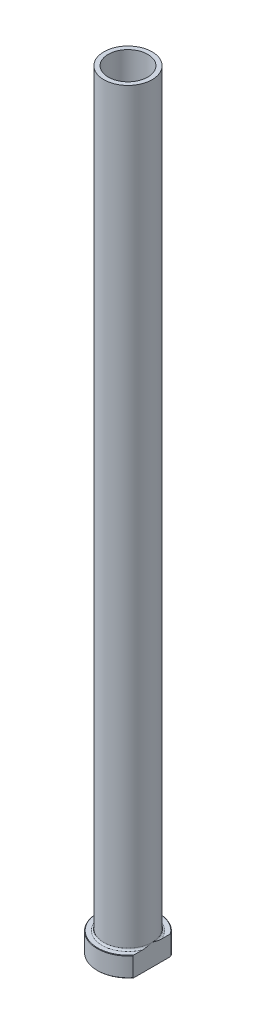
ISO-10303-21;
HEADER;
FILE_DESCRIPTION(('STEP AP214'),'2;1');
FILE_NAME('part.step','',(''),(''),'','','');
FILE_SCHEMA(('AUTOMOTIVE_DESIGN { 1 0 10303 214 1 1 1 1 }'));
ENDSEC;
DATA;
#1=APPLICATION_CONTEXT('core data for automotive mechanical design processes');
#2=APPLICATION_PROTOCOL_DEFINITION('international standard','automotive_design',2000,#1);
#3=PRODUCT_CONTEXT('',#1,'mechanical');
#4=PRODUCT('Part','Part','',(#3));
#5=PRODUCT_RELATED_PRODUCT_CATEGORY('part','',(#4));
#6=PRODUCT_DEFINITION_FORMATION('','',#4);
#7=PRODUCT_DEFINITION_CONTEXT('part definition',#1,'design');
#8=PRODUCT_DEFINITION('design','',#6,#7);
#9=PRODUCT_DEFINITION_SHAPE('','',#8);
#10=(LENGTH_UNIT() NAMED_UNIT(*) SI_UNIT(.MILLI.,.METRE.));
#11=(NAMED_UNIT(*) PLANE_ANGLE_UNIT() SI_UNIT($,.RADIAN.));
#12=(NAMED_UNIT(*) SI_UNIT($,.STERADIAN.) SOLID_ANGLE_UNIT());
#13=UNCERTAINTY_MEASURE_WITH_UNIT(LENGTH_MEASURE(1.E-05),#10,'distance_accuracy_value','');
#14=(GEOMETRIC_REPRESENTATION_CONTEXT(3) GLOBAL_UNCERTAINTY_ASSIGNED_CONTEXT((#13)) GLOBAL_UNIT_ASSIGNED_CONTEXT((#10,
#11,#12)) REPRESENTATION_CONTEXT('',''));
#15=CARTESIAN_POINT('',(0.,0.,0.));
#16=DIRECTION('',(0.,0.,1.));
#17=DIRECTION('',(1.,0.,0.));
#18=AXIS2_PLACEMENT_3D('',#15,#16,#17);
#19=CARTESIAN_POINT('',(0.,92.1876809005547,0.));
#20=DIRECTION('',(0.,1.,0.));
#21=DIRECTION('',(0.,0.,1.));
#22=AXIS2_PLACEMENT_3D('',#19,#20,#21);
#23=CYLINDRICAL_SURFACE('',#22,9.00000000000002);
#24=CARTESIAN_POINT('',(0.,350.,0.));
#25=DIRECTION('',(0.,1.,0.));
#26=DIRECTION('',(0.,0.,1.));
#27=AXIS2_PLACEMENT_3D('',#24,#25,#26);
#28=CIRCLE('',#27,9.00000000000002);
#29=CARTESIAN_POINT('',(0.,350.,9.00000000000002));
#30=VERTEX_POINT('',#29);
#31=EDGE_CURVE('E167',#30,#30,#28,.T.);
#32=ORIENTED_EDGE('',*,*,#31,.T.);
#33=EDGE_LOOP('',(#32));
#34=FACE_BOUND('',#33,.T.);
#35=CARTESIAN_POINT('',(0.,295.,0.));
#36=DIRECTION('',(0.,1.,0.));
#37=DIRECTION('',(0.,0.,1.));
#38=AXIS2_PLACEMENT_3D('',#35,#36,#37);
#39=CIRCLE('',#38,9.00000000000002);
#40=CARTESIAN_POINT('',(0.,295.,9.00000000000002));
#41=VERTEX_POINT('',#40);
#42=EDGE_CURVE('E170',#41,#41,#39,.T.);
#43=ORIENTED_EDGE('',*,*,#42,.F.);
#44=EDGE_LOOP('',(#43));
#45=FACE_BOUND('',#44,.T.);
#46=ADVANCED_FACE('F32',(#34,#45),#23,.F.);
#47=CARTESIAN_POINT('',(-9.00000000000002,350.,0.));
#48=DIRECTION('',(0.,1.,0.));
#49=DIRECTION('',(0.,0.,1.));
#50=AXIS2_PLACEMENT_3D('',#47,#48,#49);
#51=PLANE('',#50);
#52=CARTESIAN_POINT('',(0.,350.,0.));
#53=DIRECTION('',(0.,1.,0.));
#54=DIRECTION('',(0.,0.,1.));
#55=AXIS2_PLACEMENT_3D('',#52,#53,#54);
#56=CIRCLE('',#55,11.);
#57=CARTESIAN_POINT('',(0.,350.,11.));
#58=VERTEX_POINT('',#57);
#59=EDGE_CURVE('E174',#58,#58,#56,.T.);
#60=ORIENTED_EDGE('',*,*,#59,.T.);
#61=EDGE_LOOP('',(#60));
#62=FACE_BOUND('',#61,.T.);
#63=ORIENTED_EDGE('',*,*,#31,.F.);
#64=EDGE_LOOP('',(#63));
#65=FACE_BOUND('',#64,.T.);
#66=ADVANCED_FACE('F157',(#62,#65),#51,.T.);
#67=CARTESIAN_POINT('',(0.,92.1876809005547,0.));
#68=DIRECTION('',(0.,1.,0.));
#69=DIRECTION('',(0.,0.,1.));
#70=AXIS2_PLACEMENT_3D('',#67,#68,#69);
#71=CYLINDRICAL_SURFACE('',#70,11.);
#72=CARTESIAN_POINT('',(0.,9.8,0.));
#73=DIRECTION('',(0.,1.,0.));
#74=DIRECTION('',(0.,0.,1.));
#75=AXIS2_PLACEMENT_3D('',#72,#73,#74);
#76=CIRCLE('',#75,11.);
#77=CARTESIAN_POINT('',(11.,9.8,0.));
#78=VERTEX_POINT('',#77);
#79=EDGE_CURVE('E180',#78,#78,#76,.T.);
#80=ORIENTED_EDGE('',*,*,#79,.T.);
#81=EDGE_LOOP('',(#80));
#82=FACE_BOUND('',#81,.T.);
#83=ORIENTED_EDGE('',*,*,#59,.F.);
#84=EDGE_LOOP('',(#83));
#85=FACE_BOUND('',#84,.T.);
#86=ADVANCED_FACE('F162',(#82,#85),#71,.T.);
#87=CARTESIAN_POINT('',(-11.,9.,0.));
#88=DIRECTION('',(0.,1.,0.));
#89=DIRECTION('',(0.,0.,1.));
#90=AXIS2_PLACEMENT_3D('',#87,#88,#89);
#91=PLANE('',#90);
#92=DIRECTION('',(0.,0.,1.));
#93=VECTOR('',#92,1.);
#94=CARTESIAN_POINT('',(11.,9.,0.));
#95=LINE('',#94,#93);
#96=CARTESIAN_POINT('',(11.,9.,-8.33306666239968));
#97=VERTEX_POINT('',#96);
#98=CARTESIAN_POINT('',(11.,9.,-4.27083130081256));
#99=VERTEX_POINT('',#98);
#100=EDGE_CURVE('E54',#97,#99,#95,.T.);
#101=ORIENTED_EDGE('',*,*,#100,.F.);
#102=CARTESIAN_POINT('',(0.,9.,0.));
#103=DIRECTION('',(0.,1.,0.));
#104=DIRECTION('',(0.,0.,1.));
#105=AXIS2_PLACEMENT_3D('',#102,#103,#104);
#106=CIRCLE('',#105,13.7999999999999);
#107=CARTESIAN_POINT('',(11.,9.,8.33306666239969));
#108=VERTEX_POINT('',#107);
#109=EDGE_CURVE('E186',#97,#108,#106,.T.);
#110=ORIENTED_EDGE('',*,*,#109,.T.);
#111=CARTESIAN_POINT('',(11.,9.,4.27083130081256));
#112=VERTEX_POINT('',#111);
#113=EDGE_CURVE('E134',#112,#108,#95,.T.);
#114=ORIENTED_EDGE('',*,*,#113,.F.);
#115=CARTESIAN_POINT('',(0.,9.,0.));
#116=DIRECTION('',(0.,1.,0.));
#117=DIRECTION('',(0.,0.,1.));
#118=AXIS2_PLACEMENT_3D('',#115,#116,#117);
#119=CIRCLE('',#118,11.8);
#120=EDGE_CURVE('E183',#112,#99,#119,.F.);
#121=ORIENTED_EDGE('',*,*,#120,.T.);
#122=EDGE_LOOP('',(#101,#110,#114,#121));
#123=FACE_BOUND('',#122,.T.);
#124=ADVANCED_FACE('F197',(#123),#91,.T.);
#125=CARTESIAN_POINT('',(0.,92.1876809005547,0.));
#126=DIRECTION('',(0.,1.,0.));
#127=DIRECTION('',(0.,0.,1.));
#128=AXIS2_PLACEMENT_3D('',#125,#126,#127);
#129=CYLINDRICAL_SURFACE('',#128,14.);
#130=DIRECTION('',(0.,-1.,0.));
#131=VECTOR('',#130,1.);
#132=CARTESIAN_POINT('',(11.,350.,8.66025403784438));
#133=LINE('',#132,#131);
#134=CARTESIAN_POINT('',(11.,8.79999999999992,8.66025403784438));
#135=VERTEX_POINT('',#134);
#136=CARTESIAN_POINT('',(11.,0.200000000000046,8.66025403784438));
#137=VERTEX_POINT('',#136);
#138=EDGE_CURVE('E82',#135,#137,#133,.T.);
#139=ORIENTED_EDGE('',*,*,#138,.F.);
#140=CARTESIAN_POINT('',(0.,8.79999999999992,0.));
#141=DIRECTION('',(0.,1.,0.));
#142=DIRECTION('',(0.,0.,1.));
#143=AXIS2_PLACEMENT_3D('',#140,#141,#142);
#144=CIRCLE('',#143,14.);
#145=CARTESIAN_POINT('',(11.,8.79999999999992,-8.66025403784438));
#146=VERTEX_POINT('',#145);
#147=EDGE_CURVE('E95',#135,#146,#144,.F.);
#148=ORIENTED_EDGE('',*,*,#147,.T.);
#149=DIRECTION('',(0.,-1.,0.));
#150=VECTOR('',#149,1.);
#151=CARTESIAN_POINT('',(11.,350.,-8.66025403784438));
#152=LINE('',#151,#150);
#153=CARTESIAN_POINT('',(11.,0.200000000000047,-8.66025403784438));
#154=VERTEX_POINT('',#153);
#155=EDGE_CURVE('E192',#146,#154,#152,.T.);
#156=ORIENTED_EDGE('',*,*,#155,.T.);
#157=CARTESIAN_POINT('',(0.,0.200000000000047,0.));
#158=DIRECTION('',(0.,-1.,0.));
#159=DIRECTION('',(0.,0.,-1.));
#160=AXIS2_PLACEMENT_3D('',#157,#158,#159);
#161=CIRCLE('',#160,14.);
#162=EDGE_CURVE('E98',#154,#137,#161,.F.);
#163=ORIENTED_EDGE('',*,*,#162,.T.);
#164=EDGE_LOOP('',(#139,#148,#156,#163));
#165=FACE_BOUND('',#164,.T.);
#166=ADVANCED_FACE('F190',(#165),#129,.T.);
#167=CARTESIAN_POINT('',(-14.,0.,0.));
#168=DIRECTION('',(0.,-1.,0.));
#169=DIRECTION('',(0.,0.,-1.));
#170=AXIS2_PLACEMENT_3D('',#167,#168,#169);
#171=PLANE('',#170);
#172=CARTESIAN_POINT('',(0.,0.,0.));
#173=DIRECTION('',(0.,-1.,0.));
#174=DIRECTION('',(0.,0.,-1.));
#175=AXIS2_PLACEMENT_3D('',#172,#173,#174);
#176=CIRCLE('',#175,9.75000000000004);
#177=CARTESIAN_POINT('',(0.,0.,-9.75000000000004));
#178=VERTEX_POINT('',#177);
#179=EDGE_CURVE('E40',#178,#178,#176,.F.);
#180=ORIENTED_EDGE('',*,*,#179,.T.);
#181=EDGE_LOOP('',(#180));
#182=FACE_BOUND('',#181,.T.);
#183=DIRECTION('',(0.,0.,-1.));
#184=VECTOR('',#183,1.);
#185=CARTESIAN_POINT('',(11.,0.,8.66025403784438));
#186=LINE('',#185,#184);
#187=CARTESIAN_POINT('',(11.,0.,8.33306666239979));
#188=VERTEX_POINT('',#187);
#189=CARTESIAN_POINT('',(11.,0.,-8.33306666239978));
#190=VERTEX_POINT('',#189);
#191=EDGE_CURVE('E47',#188,#190,#186,.T.);
#192=ORIENTED_EDGE('',*,*,#191,.F.);
#193=CARTESIAN_POINT('',(0.,0.,0.));
#194=DIRECTION('',(0.,-1.,0.));
#195=DIRECTION('',(0.,0.,-1.));
#196=AXIS2_PLACEMENT_3D('',#193,#194,#195);
#197=CIRCLE('',#196,13.7999999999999);
#198=EDGE_CURVE('E92',#188,#190,#197,.T.);
#199=ORIENTED_EDGE('',*,*,#198,.T.);
#200=EDGE_LOOP('',(#192,#199));
#201=FACE_BOUND('',#200,.T.);
#202=ADVANCED_FACE('F91',(#182,#201),#171,.T.);
#203=CARTESIAN_POINT('',(0.,92.1876809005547,0.));
#204=DIRECTION('',(0.,1.,0.));
#205=DIRECTION('',(0.,0.,1.));
#206=AXIS2_PLACEMENT_3D('',#203,#204,#205);
#207=CYLINDRICAL_SURFACE('',#206,9.25000000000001);
#208=CARTESIAN_POINT('',(0.,0.500000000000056,0.));
#209=DIRECTION('',(0.,-1.,0.));
#210=DIRECTION('',(0.,0.,-1.));
#211=AXIS2_PLACEMENT_3D('',#208,#209,#210);
#212=CIRCLE('',#211,9.25000000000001);
#213=CARTESIAN_POINT('',(0.,0.500000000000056,-9.25000000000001));
#214=VERTEX_POINT('',#213);
#215=EDGE_CURVE('E11',#214,#214,#212,.T.);
#216=ORIENTED_EDGE('',*,*,#215,.T.);
#217=EDGE_LOOP('',(#216));
#218=FACE_BOUND('',#217,.T.);
#219=CARTESIAN_POINT('',(0.,283.,0.));
#220=DIRECTION('',(0.,1.,0.));
#221=DIRECTION('',(0.,0.,1.));
#222=AXIS2_PLACEMENT_3D('',#219,#220,#221);
#223=CIRCLE('',#222,9.25000000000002);
#224=CARTESIAN_POINT('',(0.,283.,9.25000000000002));
#225=VERTEX_POINT('',#224);
#226=EDGE_CURVE('E172',#225,#225,#223,.T.);
#227=ORIENTED_EDGE('',*,*,#226,.T.);
#228=EDGE_LOOP('',(#227));
#229=FACE_BOUND('',#228,.T.);
#230=ADVANCED_FACE('F215',(#218,#229),#207,.F.);
#231=CARTESIAN_POINT('',(0.,283.,0.));
#232=DIRECTION('',(0.,-1.,0.));
#233=DIRECTION('',(0.,0.,-1.));
#234=AXIS2_PLACEMENT_3D('',#231,#232,#233);
#235=CONICAL_SURFACE('',#234,9.25000000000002,0.0208303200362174);
#236=ORIENTED_EDGE('',*,*,#42,.T.);
#237=EDGE_LOOP('',(#236));
#238=FACE_BOUND('',#237,.T.);
#239=ORIENTED_EDGE('',*,*,#226,.F.);
#240=EDGE_LOOP('',(#239));
#241=FACE_BOUND('',#240,.T.);
#242=ADVANCED_FACE('F111',(#238,#241),#235,.F.);
#243=CARTESIAN_POINT('',(0.,9.8,0.));
#244=DIRECTION('',(0.,1.,0.));
#245=DIRECTION('',(0.,0.,1.));
#246=AXIS2_PLACEMENT_3D('',#243,#244,#245);
#247=TOROIDAL_SURFACE('',#246,11.8,0.8);
#248=ORIENTED_EDGE('',*,*,#120,.F.);
#249=CARTESIAN_POINT('',(11.,9.8,0.));
#250=CARTESIAN_POINT('',(11.,9.8000010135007,-1.1690142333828E-10));
#251=CARTESIAN_POINT('',(11.,9.80000202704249,3.62636844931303E-07));
#252=CARTESIAN_POINT('',(11.,9.80000392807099,1.38767088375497E-06));
#253=CARTESIAN_POINT('',(11.,9.80000479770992,2.07263830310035E-06));
#254=CARTESIAN_POINT('',(11.,9.80000659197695,3.71036756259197E-06));
#255=CARTESIAN_POINT('',(11.,9.80000749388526,4.6893031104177E-06));
#256=CARTESIAN_POINT('',(11.,9.8000091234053,6.73011686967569E-06));
#257=CARTESIAN_POINT('',(11.,9.80000985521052,7.78888257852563E-06));
#258=CARTESIAN_POINT('',(11.,9.8000125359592,1.18457672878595E-05));
#259=CARTESIAN_POINT('',(11.,9.80001433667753,1.49465092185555E-05));
#260=CARTESIAN_POINT('',(11.,9.8000173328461,2.112267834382E-05));
#261=CARTESIAN_POINT('',(11.,9.80001856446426,2.41813383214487E-05));
#262=CARTESIAN_POINT('',(11.,9.80002366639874,3.70013792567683E-05));
#263=CARTESIAN_POINT('',(11.,9.80002742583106,4.68141765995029E-05));
#264=CARTESIAN_POINT('',(11.,9.80003302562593,6.54425732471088E-05));
#265=CARTESIAN_POINT('',(11.,9.80003506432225,7.4198414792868E-05));
#266=CARTESIAN_POINT('',(11.,9.80004981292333,0.000138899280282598));
#267=CARTESIAN_POINT('',(11.,9.80006088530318,0.000195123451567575));
#268=CARTESIAN_POINT('',(11.,9.80010935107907,0.000417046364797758));
#269=CARTESIAN_POINT('',(11.,9.80015570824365,0.00058074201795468));
#270=CARTESIAN_POINT('',(11.,9.80033600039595,0.001228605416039));
#271=CARTESIAN_POINT('',(11.,9.80046404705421,0.00171390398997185));
#272=CARTESIAN_POINT('',(11.,9.8009765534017,0.00364143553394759));
#273=CARTESIAN_POINT('',(11.,9.80136837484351,0.0050822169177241));
#274=CARTESIAN_POINT('',(11.,9.80300002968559,0.0110983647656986));
#275=CARTESIAN_POINT('',(11.,9.80423069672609,0.0156755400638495));
#276=CARTESIAN_POINT('',(10.9999999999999,9.82474721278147,0.0919599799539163));
#277=CARTESIAN_POINT('',(11.,9.84411511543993,0.163651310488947));
#278=CARTESIAN_POINT('',(11.,9.88193435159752,0.304144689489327));
#279=CARTESIAN_POINT('',(11.,9.9003908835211,0.372945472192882));
#280=CARTESIAN_POINT('',(11.,9.93953155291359,0.519420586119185));
#281=CARTESIAN_POINT('',(11.,9.96019740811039,0.597099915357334));
#282=CARTESIAN_POINT('',(11.,10.001471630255,0.753402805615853));
#283=CARTESIAN_POINT('',(11.,10.0220767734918,0.832027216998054));
#284=CARTESIAN_POINT('',(11.,10.0569012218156,0.966276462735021));
#285=CARTESIAN_POINT('',(11.,10.0712190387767,1.02187571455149));
#286=CARTESIAN_POINT('',(11.,10.0995828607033,1.13298938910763));
#287=CARTESIAN_POINT('',(11.,10.1136294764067,1.18850365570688));
#288=CARTESIAN_POINT('',(11.,10.1546367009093,1.35225812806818));
#289=CARTESIAN_POINT('',(11.,10.1812165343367,1.46059357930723));
#290=CARTESIAN_POINT('',(11.,10.2669117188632,1.81933910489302));
#291=CARTESIAN_POINT('',(11.,10.3231642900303,2.07044657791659));
#292=CARTESIAN_POINT('',(11.,10.4250125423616,2.57779828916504));
#293=CARTESIAN_POINT('',(11.,10.4704839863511,2.8340686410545));
#294=CARTESIAN_POINT('',(11.,10.5272211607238,3.23096220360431));
#295=CARTESIAN_POINT('',(11.,10.5446090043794,3.37070252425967));
#296=CARTESIAN_POINT('',(11.,10.5730475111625,3.6508143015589));
#297=CARTESIAN_POINT('',(11.,10.5840998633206,3.79118557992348));
#298=CARTESIAN_POINT('',(11.,10.5982304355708,4.07161741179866));
#299=CARTESIAN_POINT('',(11.,10.6013499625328,4.21167576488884));
#300=CARTESIAN_POINT('',(11.,10.5975625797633,4.49161919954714));
#301=CARTESIAN_POINT('',(11.,10.5906655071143,4.63150431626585));
#302=CARTESIAN_POINT('',(11.,10.5704363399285,4.8393109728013));
#303=CARTESIAN_POINT('',(11.,10.5621463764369,4.90772588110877));
#304=CARTESIAN_POINT('',(11.,10.5417448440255,5.04405523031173));
#305=CARTESIAN_POINT('',(11.,10.5296301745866,5.11196921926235));
#306=CARTESIAN_POINT('',(11.,10.5009997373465,5.2461029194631));
#307=CARTESIAN_POINT('',(11.,10.4845340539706,5.31233305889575));
#308=CARTESIAN_POINT('',(11.,10.4461783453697,5.44314716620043));
#309=CARTESIAN_POINT('',(11.,10.424294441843,5.50773290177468));
#310=CARTESIAN_POINT('',(11.,10.3734211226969,5.63494480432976));
#311=CARTESIAN_POINT('',(11.,10.344361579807,5.69754429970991));
#312=CARTESIAN_POINT('',(11.,10.2940125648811,5.7875857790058));
#313=CARTESIAN_POINT('',(11.,10.2761248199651,5.81692841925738));
#314=CARTESIAN_POINT('',(11.,10.2377448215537,5.87384301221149));
#315=CARTESIAN_POINT('',(11.,10.2172553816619,5.90141683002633));
#316=CARTESIAN_POINT('',(11.,10.1754926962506,5.95144540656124));
#317=CARTESIAN_POINT('',(11.,10.1545053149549,5.97413611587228));
#318=CARTESIAN_POINT('',(11.,10.109817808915,6.01675330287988));
#319=CARTESIAN_POINT('',(11.,10.0861159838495,6.03667803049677));
#320=CARTESIAN_POINT('',(11.,10.0355211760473,6.07288913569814));
#321=CARTESIAN_POINT('',(11.,10.008588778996,6.08912169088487));
#322=CARTESIAN_POINT('',(11.,9.95208821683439,6.11604527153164));
#323=CARTESIAN_POINT('',(11.,9.92252876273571,6.12675386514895));
#324=CARTESIAN_POINT('',(11.,9.87044933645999,6.13915978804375));
#325=CARTESIAN_POINT('',(11.,9.84833164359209,6.14255775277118));
#326=CARTESIAN_POINT('',(11.,9.80383923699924,6.14553082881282));
#327=CARTESIAN_POINT('',(11.,9.78146463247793,6.14510750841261));
#328=CARTESIAN_POINT('',(11.,9.73715415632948,6.14047859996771));
#329=CARTESIAN_POINT('',(11.,9.71521765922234,6.13627886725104));
#330=CARTESIAN_POINT('',(11.,9.67228934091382,6.12446633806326));
#331=CARTESIAN_POINT('',(11.,9.6512982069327,6.11685110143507));
#332=CARTESIAN_POINT('',(11.,9.60293880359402,6.09531376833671));
#333=CARTESIAN_POINT('',(11.,9.57614979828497,6.08009633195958));
#334=CARTESIAN_POINT('',(11.,9.52533680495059,6.04559207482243));
#335=CARTESIAN_POINT('',(11.,9.50131971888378,6.02629542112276));
#336=CARTESIAN_POINT('',(11.,9.44252607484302,5.97248581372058));
#337=CARTESIAN_POINT('',(11.,9.40981527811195,5.93573547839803));
#338=CARTESIAN_POINT('',(11.,9.35019076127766,5.85789950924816));
#339=CARTESIAN_POINT('',(11.,9.32328591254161,5.81680738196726));
#340=CARTESIAN_POINT('',(11.,9.27531247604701,5.73382009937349));
#341=CARTESIAN_POINT('',(11.,9.25403723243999,5.69204233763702));
#342=CARTESIAN_POINT('',(11.,9.2150716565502,5.60682590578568));
#343=CARTESIAN_POINT('',(11.,9.19738479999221,5.56338567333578));
#344=CARTESIAN_POINT('',(11.,9.16492416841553,5.47505507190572));
#345=CARTESIAN_POINT('',(11.,9.15017444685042,5.43015597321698));
#346=CARTESIAN_POINT('',(11.,9.12332484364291,5.33960740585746));
#347=CARTESIAN_POINT('',(11.,9.11122363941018,5.29395832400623));
#348=CARTESIAN_POINT('',(11.,9.08512909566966,5.18461425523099));
#349=CARTESIAN_POINT('',(11.,9.07217244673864,5.12067246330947));
#350=CARTESIAN_POINT('',(11.,9.04991113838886,4.99214785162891));
#351=CARTESIAN_POINT('',(11.,9.04060805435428,4.92756476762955));
#352=CARTESIAN_POINT('',(11.,9.01731839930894,4.73294213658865));
#353=CARTESIAN_POINT('',(11.,9.00801869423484,4.60233754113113));
#354=CARTESIAN_POINT('',(11.,8.99902947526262,4.34550193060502));
#355=CARTESIAN_POINT('',(11.,8.99901276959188,4.21927902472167));
#356=CARTESIAN_POINT('',(11.,9.00595929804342,3.96771196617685));
#357=CARTESIAN_POINT('',(11.,9.01288556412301,3.84236670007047));
#358=CARTESIAN_POINT('',(11.,9.03307410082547,3.58284783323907));
#359=CARTESIAN_POINT('',(11.,9.04676832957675,3.44870920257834));
#360=CARTESIAN_POINT('',(11.,9.07939011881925,3.18114709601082));
#361=CARTESIAN_POINT('',(11.,9.09831526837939,3.04772331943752));
#362=CARTESIAN_POINT('',(11.,9.14092023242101,2.77842123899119));
#363=CARTESIAN_POINT('',(11.,9.16470161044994,2.64255921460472));
#364=CARTESIAN_POINT('',(11.,9.21593088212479,2.37116504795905));
#365=CARTESIAN_POINT('',(11.,9.24338827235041,2.23563471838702));
#366=CARTESIAN_POINT('',(11.,9.31183649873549,1.91532204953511));
#367=CARTESIAN_POINT('',(11.,9.35408384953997,1.73080986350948));
#368=CARTESIAN_POINT('',(11.,9.44184141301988,1.36477440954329));
#369=CARTESIAN_POINT('',(11.,9.48730948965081,1.18324089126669));
#370=CARTESIAN_POINT('',(11.,9.55452451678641,0.921934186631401));
#371=CARTESIAN_POINT('',(11.,9.57534575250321,0.841920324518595));
#372=CARTESIAN_POINT('',(11.,9.61742284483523,0.681633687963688));
#373=CARTESIAN_POINT('',(11.,9.63868020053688,0.601361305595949));
#374=CARTESIAN_POINT('',(11.,9.68246779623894,0.436916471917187));
#375=CARTESIAN_POINT('',(11.,9.70500908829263,0.35274702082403));
#376=CARTESIAN_POINT('',(11.,9.74991333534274,0.185809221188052));
#377=CARTESIAN_POINT('',(11.0000000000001,9.77227331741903,0.103040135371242));
#378=CARTESIAN_POINT('',(11.,9.79577053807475,0.0156708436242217));
#379=CARTESIAN_POINT('',(11.,9.79700248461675,0.0110889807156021));
#380=CARTESIAN_POINT('',(11.,9.79863444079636,0.00507176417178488));
#381=CARTESIAN_POINT('',(11.,9.79902527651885,0.00363459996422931));
#382=CARTESIAN_POINT('',(11.,9.79953658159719,0.00171158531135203));
#383=CARTESIAN_POINT('',(11.,9.7996643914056,0.00122718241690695));
#384=CARTESIAN_POINT('',(11.,9.79984439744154,0.000580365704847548));
#385=CARTESIAN_POINT('',(11.,9.79989071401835,0.000416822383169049));
#386=CARTESIAN_POINT('',(11.,9.79993914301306,0.000195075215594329));
#387=CARTESIAN_POINT('',(11.,9.79995021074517,0.000138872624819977));
#388=CARTESIAN_POINT('',(11.,9.79996494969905,7.41937272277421E-05));
#389=CARTESIAN_POINT('',(11.,9.79996698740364,6.54391041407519E-05));
#390=CARTESIAN_POINT('',(11.,9.79997258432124,4.68131883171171E-05));
#391=CARTESIAN_POINT('',(11.,9.79997634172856,3.7001588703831E-05));
#392=CARTESIAN_POINT('',(11.,9.7999814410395,2.41827838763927E-05));
#393=CARTESIAN_POINT('',(11.,9.79998267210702,2.11242150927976E-05));
#394=CARTESIAN_POINT('',(11.,9.79998566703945,1.4948136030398E-05));
#395=CARTESIAN_POINT('',(11.,9.79998746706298,1.18473819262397E-05));
#396=CARTESIAN_POINT('',(11.,9.79999014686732,7.79037294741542E-06));
#397=CARTESIAN_POINT('',(11.,9.79999087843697,6.73154510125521E-06));
#398=CARTESIAN_POINT('',(11.,9.79999250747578,4.69056454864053E-06));
#399=CARTESIAN_POINT('',(11.,9.79999340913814,3.7115229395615E-06));
#400=CARTESIAN_POINT('',(11.,9.79999520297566,2.0735436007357E-06));
#401=CARTESIAN_POINT('',(11.,9.79999607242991,1.38844123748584E-06));
#402=CARTESIAN_POINT('',(11.,9.79999797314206,3.63067802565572E-07));
#403=CARTESIAN_POINT('',(11.,9.79999898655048,1.16899927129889E-10));
#404=CARTESIAN_POINT('',(11.,9.8,0.));
#405=B_SPLINE_CURVE_WITH_KNOTS('',3,(#249,#250,#251,#252,#253,#254,#255,#256,#257,#258,#259,
#260,#261,#262,#263,#264,#265,#266,#267,#268,#269,#270,#271,#272,#273,#274,#275,#276,#277,#278,
#279,#280,#281,#282,#283,#284,#285,#286,#287,#288,#289,#290,#291,#292,#293,#294,#295,#296,#297,
#298,#299,#300,#301,#302,#303,#304,#305,#306,#307,#308,#309,#310,#311,#312,#313,#314,#315,#316,
#317,#318,#319,#320,#321,#322,#323,#324,#325,#326,#327,#328,#329,#330,#331,#332,#333,#334,#335,
#336,#337,#338,#339,#340,#341,#342,#343,#344,#345,#346,#347,#348,#349,#350,#351,#352,#353,#354,
#355,#356,#357,#358,#359,#360,#361,#362,#363,#364,#365,#366,#367,#368,#369,#370,#371,#372,#373,
#374,#375,#376,#377,#378,#379,#380,#381,#382,#383,#384,#385,#386,#387,#388,#389,#390,#391,#392,
#393,#394,#395,#396,#397,#398,#399,#400,#401,#402,#403,#404),.UNSPECIFIED.,.T.,.F.,(4,2,2,2,2,2,
2,2,2,2,2,2,2,2,2,2,2,2,2,2,2,2,2,2,2,2,2,2,2,2,2,2,2,2,2,2,2,2,2,2,2,2,2,2,2,2,2,2,2,2,2,2,2,2,
2,2,2,2,2,2,2,2,2,2,2,2,2,2,2,2,2,2,2,2,2,2,2,4),(0.,3.06075816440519E-06,6.37973016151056E-06,
1.03502600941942E-05,1.42089639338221E-05,2.49252461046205E-05,3.4808542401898E-05,
6.62739268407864E-05,9.32104281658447E-05,0.000265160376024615,0.000775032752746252,
0.00228129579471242,0.00675996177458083,0.0209798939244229,0.243756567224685,0.457458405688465,
0.698601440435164,0.94243948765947,1.11467870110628,1.28646938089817,1.62111125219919,
2.39296447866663,3.17332138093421,3.59566656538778,4.01789910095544,4.43792849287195,
4.85754566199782,5.06420795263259,5.27103820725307,5.47558418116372,5.67990009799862,
5.88629782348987,5.98928489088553,6.09216151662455,6.18469603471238,6.27728883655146,
6.37115541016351,6.46472158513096,6.53154940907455,6.59834980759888,6.66504681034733,
6.73179153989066,6.82369899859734,6.91583057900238,7.06259901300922,7.20959014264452,
7.35003074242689,7.49060673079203,7.63229046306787,7.77390328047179,7.96948934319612,
8.1651596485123,8.55744262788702,8.93589815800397,9.31234923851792,9.7167301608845,
10.1209250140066,10.5346477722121,10.9494607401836,11.5172595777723,12.0786596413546,
12.3266950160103,12.5758117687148,12.8372206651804,13.0944202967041,13.1086548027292,
13.1131222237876,13.1146257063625,13.1151351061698,13.1153069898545,13.1153339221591,
13.1153653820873,13.1153752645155,13.1153859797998,13.1153898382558,13.1153938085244,
13.1153971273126,13.1154001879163),.UNSPECIFIED.);
#406=EDGE_CURVE('E126',#112,#78,#405,.T.);
#407=ORIENTED_EDGE('',*,*,#406,.T.);
#408=ORIENTED_EDGE('',*,*,#79,.F.);
#409=CARTESIAN_POINT('',(11.,9.8,0.));
#410=CARTESIAN_POINT('',(11.,9.79999898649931,1.16906269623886E-10));
#411=CARTESIAN_POINT('',(11.,9.79999797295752,-3.62636839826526E-07));
#412=CARTESIAN_POINT('',(11.,9.79999607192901,-1.38767087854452E-06));
#413=CARTESIAN_POINT('',(11.,9.79999520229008,-2.07263829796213E-06));
#414=CARTESIAN_POINT('',(11.,9.79999340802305,-3.71036755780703E-06));
#415=CARTESIAN_POINT('',(11.,9.79999250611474,-4.68930310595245E-06));
#416=CARTESIAN_POINT('',(11.,9.79999087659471,-6.73011686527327E-06));
#417=CARTESIAN_POINT('',(11.,9.79999014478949,-7.78888257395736E-06));
#418=CARTESIAN_POINT('',(11.,9.7999874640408,-1.18457672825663E-05));
#419=CARTESIAN_POINT('',(11.,9.79998566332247,-1.49465092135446E-05));
#420=CARTESIAN_POINT('',(11.,9.7999826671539,-2.11226783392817E-05));
#421=CARTESIAN_POINT('',(11.,9.79998143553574,-2.41813383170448E-05));
#422=CARTESIAN_POINT('',(11.,9.79997633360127,-3.70013792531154E-05));
#423=CARTESIAN_POINT('',(11.,9.79997257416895,-4.6814176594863E-05));
#424=CARTESIAN_POINT('',(11.,9.79996697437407,-6.54425732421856E-05));
#425=CARTESIAN_POINT('',(11.,9.79996493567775,-7.41984147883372E-05));
#426=CARTESIAN_POINT('',(11.,9.79995018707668,-0.000138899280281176));
#427=CARTESIAN_POINT('',(11.,9.79993911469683,-0.000195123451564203));
#428=CARTESIAN_POINT('',(11.,9.79989064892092,-0.000417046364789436));
#429=CARTESIAN_POINT('',(11.,9.79984429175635,-0.000580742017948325));
#430=CARTESIAN_POINT('',(11.,9.79966399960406,-0.00122860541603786));
#431=CARTESIAN_POINT('',(11.,9.7995359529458,-0.00171390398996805));
#432=CARTESIAN_POINT('',(11.,9.79902344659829,-0.00364143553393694));
#433=CARTESIAN_POINT('',(11.,9.79863162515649,-0.00508221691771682));
#434=CARTESIAN_POINT('',(11.,9.79699997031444,-0.0110983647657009));
#435=CARTESIAN_POINT('',(11.,9.79576930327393,-0.0156755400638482));
#436=CARTESIAN_POINT('',(11.0000000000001,9.77525278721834,-0.0919599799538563));
#437=CARTESIAN_POINT('',(11.,9.75588488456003,-0.163651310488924));
#438=CARTESIAN_POINT('',(11.,9.71806564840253,-0.304144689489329));
#439=CARTESIAN_POINT('',(11.,9.69960911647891,-0.372945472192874));
#440=CARTESIAN_POINT('',(11.,9.6604684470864,-0.519420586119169));
#441=CARTESIAN_POINT('',(11.,9.63980259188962,-0.597099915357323));
#442=CARTESIAN_POINT('',(11.,9.59852836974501,-0.753402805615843));
#443=CARTESIAN_POINT('',(11.,9.5779232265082,-0.832027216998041));
#444=CARTESIAN_POINT('',(11.,9.54309877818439,-0.966276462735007));
#445=CARTESIAN_POINT('',(11.,9.52878096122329,-1.02187571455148));
#446=CARTESIAN_POINT('',(11.,9.50041713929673,-1.13298938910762));
#447=CARTESIAN_POINT('',(11.,9.48637052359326,-1.18850365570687));
#448=CARTESIAN_POINT('',(11.,9.44536329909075,-1.35225812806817));
#449=CARTESIAN_POINT('',(11.,9.41878346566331,-1.46059357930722));
#450=CARTESIAN_POINT('',(11.,9.33308828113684,-1.81933910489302));
#451=CARTESIAN_POINT('',(11.,9.27683570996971,-2.07044657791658));
#452=CARTESIAN_POINT('',(11.,9.17498745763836,-2.57779828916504));
#453=CARTESIAN_POINT('',(11.,9.12951601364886,-2.8340686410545));
#454=CARTESIAN_POINT('',(11.,9.0727788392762,-3.23096220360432));
#455=CARTESIAN_POINT('',(11.,9.05539099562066,-3.37070252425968));
#456=CARTESIAN_POINT('',(11.,9.02695248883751,-3.6508143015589));
#457=CARTESIAN_POINT('',(11.,9.01590013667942,-3.79118557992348));
#458=CARTESIAN_POINT('',(11.,9.00176956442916,-4.07161741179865));
#459=CARTESIAN_POINT('',(11.,8.99865003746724,-4.21167576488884));
#460=CARTESIAN_POINT('',(11.,9.00243742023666,-4.49161919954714));
#461=CARTESIAN_POINT('',(11.,9.00933449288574,-4.63150431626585));
#462=CARTESIAN_POINT('',(11.,9.02956366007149,-4.8393109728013));
#463=CARTESIAN_POINT('',(11.,9.03785362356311,-4.90772588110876));
#464=CARTESIAN_POINT('',(11.,9.05825515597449,-5.04405523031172));
#465=CARTESIAN_POINT('',(11.,9.07036982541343,-5.11196921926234));
#466=CARTESIAN_POINT('',(11.,9.0990002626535,-5.24610291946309));
#467=CARTESIAN_POINT('',(11.,9.11546594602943,-5.31233305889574));
#468=CARTESIAN_POINT('',(11.,9.1538216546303,-5.44314716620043));
#469=CARTESIAN_POINT('',(11.,9.17570555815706,-5.50773290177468));
#470=CARTESIAN_POINT('',(11.,9.22657887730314,-5.63494480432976));
#471=CARTESIAN_POINT('',(11.,9.25563842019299,-5.69754429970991));
#472=CARTESIAN_POINT('',(11.,9.30598743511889,-5.78758577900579));
#473=CARTESIAN_POINT('',(11.,9.32387518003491,-5.81692841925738));
#474=CARTESIAN_POINT('',(11.,9.36225517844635,-5.87384301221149));
#475=CARTESIAN_POINT('',(11.,9.38274461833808,-5.90141683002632));
#476=CARTESIAN_POINT('',(11.,9.42450730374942,-5.95144540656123));
#477=CARTESIAN_POINT('',(11.,9.44549468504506,-5.97413611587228));
#478=CARTESIAN_POINT('',(11.,9.490182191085,-6.01675330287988));
#479=CARTESIAN_POINT('',(11.,9.51388401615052,-6.03667803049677));
#480=CARTESIAN_POINT('',(11.,9.56447882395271,-6.07288913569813));
#481=CARTESIAN_POINT('',(11.,9.59141122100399,-6.08912169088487));
#482=CARTESIAN_POINT('',(11.,9.64791178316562,-6.11604527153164));
#483=CARTESIAN_POINT('',(11.,9.67747123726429,-6.12675386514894));
#484=CARTESIAN_POINT('',(11.,9.72955066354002,-6.13915978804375));
#485=CARTESIAN_POINT('',(11.,9.75166835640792,-6.14255775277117));
#486=CARTESIAN_POINT('',(11.,9.79616076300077,-6.14553082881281));
#487=CARTESIAN_POINT('',(11.,9.81853536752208,-6.14510750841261));
#488=CARTESIAN_POINT('',(11.,9.86284584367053,-6.14047859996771));
#489=CARTESIAN_POINT('',(11.,9.88478234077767,-6.13627886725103));
#490=CARTESIAN_POINT('',(11.,9.92771065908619,-6.12446633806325));
#491=CARTESIAN_POINT('',(11.,9.94870179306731,-6.11685110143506));
#492=CARTESIAN_POINT('',(11.,9.99706119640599,-6.0953137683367));
#493=CARTESIAN_POINT('',(11.,10.023850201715,-6.08009633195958));
#494=CARTESIAN_POINT('',(11.,10.0746631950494,-6.04559207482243));
#495=CARTESIAN_POINT('',(11.,10.0986802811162,-6.02629542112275));
#496=CARTESIAN_POINT('',(11.,10.157473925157,-5.97248581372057));
#497=CARTESIAN_POINT('',(11.,10.1901847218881,-5.93573547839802));
#498=CARTESIAN_POINT('',(11.,10.2498092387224,-5.85789950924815));
#499=CARTESIAN_POINT('',(11.,10.2767140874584,-5.81680738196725));
#500=CARTESIAN_POINT('',(11.,10.324687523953,-5.73382009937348));
#501=CARTESIAN_POINT('',(11.,10.34596276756,-5.692042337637));
#502=CARTESIAN_POINT('',(11.,10.3849283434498,-5.60682590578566));
#503=CARTESIAN_POINT('',(11.,10.4026152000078,-5.56338567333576));
#504=CARTESIAN_POINT('',(11.,10.4350758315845,-5.47505507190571));
#505=CARTESIAN_POINT('',(11.,10.4498255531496,-5.43015597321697));
#506=CARTESIAN_POINT('',(11.,10.4766751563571,-5.33960740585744));
#507=CARTESIAN_POINT('',(11.,10.4887763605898,-5.2939583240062));
#508=CARTESIAN_POINT('',(11.,10.5148709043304,-5.18461425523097));
#509=CARTESIAN_POINT('',(11.,10.5278275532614,-5.12067246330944));
#510=CARTESIAN_POINT('',(11.,10.5500888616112,-4.99214785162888));
#511=CARTESIAN_POINT('',(11.,10.5593919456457,-4.92756476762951));
#512=CARTESIAN_POINT('',(11.,10.5826816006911,-4.73294213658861));
#513=CARTESIAN_POINT('',(11.,10.5919813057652,-4.60233754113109));
#514=CARTESIAN_POINT('',(11.,10.6009705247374,-4.34550193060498));
#515=CARTESIAN_POINT('',(11.,10.6009872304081,-4.21927902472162));
#516=CARTESIAN_POINT('',(11.,10.5940407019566,-3.96771196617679));
#517=CARTESIAN_POINT('',(11.,10.587114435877,-3.84236670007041));
#518=CARTESIAN_POINT('',(11.,10.5669258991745,-3.58284783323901));
#519=CARTESIAN_POINT('',(11.,10.5532316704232,-3.44870920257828));
#520=CARTESIAN_POINT('',(11.,10.5206098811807,-3.18114709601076));
#521=CARTESIAN_POINT('',(11.,10.5016847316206,-3.04772331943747));
#522=CARTESIAN_POINT('',(11.,10.459079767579,-2.77842123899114));
#523=CARTESIAN_POINT('',(11.,10.4352983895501,-2.64255921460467));
#524=CARTESIAN_POINT('',(11.,10.3840691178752,-2.37116504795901));
#525=CARTESIAN_POINT('',(11.,10.3566117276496,-2.23563471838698));
#526=CARTESIAN_POINT('',(11.,10.2881635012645,-1.91532204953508));
#527=CARTESIAN_POINT('',(11.,10.24591615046,-1.73080986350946));
#528=CARTESIAN_POINT('',(11.,10.1581585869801,-1.36477440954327));
#529=CARTESIAN_POINT('',(11.,10.1126905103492,-1.18324089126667));
#530=CARTESIAN_POINT('',(11.,10.0454754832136,-0.921934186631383));
#531=CARTESIAN_POINT('',(11.,10.0246542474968,-0.841920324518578));
#532=CARTESIAN_POINT('',(11.,9.98257715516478,-0.681633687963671));
#533=CARTESIAN_POINT('',(11.,9.96131979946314,-0.60136130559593));
#534=CARTESIAN_POINT('',(11.,9.91753220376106,-0.436916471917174));
#535=CARTESIAN_POINT('',(11.,9.89499091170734,-0.352747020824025));
#536=CARTESIAN_POINT('',(11.,9.8500866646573,-0.185809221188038));
#537=CARTESIAN_POINT('',(11.,9.82772668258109,-0.103040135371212));
#538=CARTESIAN_POINT('',(11.,9.80422946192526,-0.0156708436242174));
#539=CARTESIAN_POINT('',(11.,9.80299751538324,-0.0110889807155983));
#540=CARTESIAN_POINT('',(11.,9.80136555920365,-0.00507176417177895));
#541=CARTESIAN_POINT('',(11.,9.80097472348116,-0.00363459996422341));
#542=CARTESIAN_POINT('',(11.,9.80046341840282,-0.00171158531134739));
#543=CARTESIAN_POINT('',(11.,9.8003356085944,-0.00122718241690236));
#544=CARTESIAN_POINT('',(11.,9.80015560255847,-0.000580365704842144));
#545=CARTESIAN_POINT('',(11.,9.80010928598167,-0.000416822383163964));
#546=CARTESIAN_POINT('',(11.,9.80006085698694,-0.000195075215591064));
#547=CARTESIAN_POINT('',(11.,9.80004978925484,-0.000138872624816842));
#548=CARTESIAN_POINT('',(11.,9.80003505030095,-7.41937272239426E-05));
#549=CARTESIAN_POINT('',(11.,9.80003301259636,-6.54391041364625E-05));
#550=CARTESIAN_POINT('',(11.,9.80002741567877,-4.68131883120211E-05));
#551=CARTESIAN_POINT('',(11.,9.80002365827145,-3.7001588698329E-05));
#552=CARTESIAN_POINT('',(11.,9.80001855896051,-2.41827838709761E-05));
#553=CARTESIAN_POINT('',(11.,9.80001732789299,-2.11242150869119E-05));
#554=CARTESIAN_POINT('',(11.,9.80001433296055,-1.49481360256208E-05));
#555=CARTESIAN_POINT('',(11.,9.80001253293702,-1.1847381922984E-05));
#556=CARTESIAN_POINT('',(11.,9.80000985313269,-7.79037294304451E-06));
#557=CARTESIAN_POINT('',(11.,9.80000912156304,-6.73154509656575E-06));
#558=CARTESIAN_POINT('',(11.,9.80000749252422,-4.69056454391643E-06));
#559=CARTESIAN_POINT('',(11.,9.80000659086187,-3.71152293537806E-06));
#560=CARTESIAN_POINT('',(11.,9.80000479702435,-2.07354359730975E-06));
#561=CARTESIAN_POINT('',(11.,9.80000392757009,-1.38844123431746E-06));
#562=CARTESIAN_POINT('',(11.,9.80000202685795,-3.63067798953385E-07));
#563=CARTESIAN_POINT('',(11.,9.80000101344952,-1.16895959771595E-10));
#564=CARTESIAN_POINT('',(11.,9.8,0.));
#565=B_SPLINE_CURVE_WITH_KNOTS('',3,(#409,#410,#411,#412,#413,#414,#415,#416,#417,#418,#419,
#420,#421,#422,#423,#424,#425,#426,#427,#428,#429,#430,#431,#432,#433,#434,#435,#436,#437,#438,
#439,#440,#441,#442,#443,#444,#445,#446,#447,#448,#449,#450,#451,#452,#453,#454,#455,#456,#457,
#458,#459,#460,#461,#462,#463,#464,#465,#466,#467,#468,#469,#470,#471,#472,#473,#474,#475,#476,
#477,#478,#479,#480,#481,#482,#483,#484,#485,#486,#487,#488,#489,#490,#491,#492,#493,#494,#495,
#496,#497,#498,#499,#500,#501,#502,#503,#504,#505,#506,#507,#508,#509,#510,#511,#512,#513,#514,
#515,#516,#517,#518,#519,#520,#521,#522,#523,#524,#525,#526,#527,#528,#529,#530,#531,#532,#533,
#534,#535,#536,#537,#538,#539,#540,#541,#542,#543,#544,#545,#546,#547,#548,#549,#550,#551,#552,
#553,#554,#555,#556,#557,#558,#559,#560,#561,#562,#563,#564),.UNSPECIFIED.,.T.,.F.,(4,2,2,2,2,2,
2,2,2,2,2,2,2,2,2,2,2,2,2,2,2,2,2,2,2,2,2,2,2,2,2,2,2,2,2,2,2,2,2,2,2,2,2,2,2,2,2,2,2,2,2,2,2,2,
2,2,2,2,2,2,2,2,2,2,2,2,2,2,2,2,2,2,2,2,2,2,2,4),(0.,3.06075816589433E-06,6.37973016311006E-06,
1.035026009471E-05,1.4208963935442E-05,2.49252461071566E-05,3.48085424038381E-05,
6.62739268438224E-05,9.32104281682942E-05,0.000265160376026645,0.000775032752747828,
0.00228129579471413,0.00675996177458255,0.0209798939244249,0.243756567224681,0.45745840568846,
0.69860144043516,0.942439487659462,1.11467870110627,1.28646938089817,1.62111125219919,
2.39296447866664,3.17332138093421,3.59566656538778,4.01789910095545,4.43792849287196,
4.85754566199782,5.06420795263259,5.27103820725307,5.47558418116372,5.67990009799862,
5.88629782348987,5.98928489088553,6.09216151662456,6.18469603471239,6.27728883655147,
6.37115541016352,6.46472158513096,6.53154940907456,6.59834980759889,6.66504681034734,
6.73179153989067,6.82369899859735,6.91583057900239,7.06259901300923,7.20959014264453,
7.35003074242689,7.49060673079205,7.63229046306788,7.77390328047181,7.96948934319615,
8.16515964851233,8.55744262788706,8.93589815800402,9.31234923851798,9.71673016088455,
10.1209250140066,10.5346477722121,10.9494607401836,11.5172595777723,12.0786596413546,
12.3266950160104,12.5758117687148,12.8372206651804,13.0944202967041,13.1086548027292,
13.1131222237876,13.1146257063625,13.1151351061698,13.1153069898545,13.1153339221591,
13.1153653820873,13.1153752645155,13.1153859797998,13.1153898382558,13.1153938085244,
13.1153971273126,13.1154001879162),.UNSPECIFIED.);
#566=EDGE_CURVE('E135',#78,#99,#565,.T.);
#567=ORIENTED_EDGE('',*,*,#566,.T.);
#568=EDGE_LOOP('',(#248,#407,#408,#567));
#569=FACE_BOUND('',#568,.T.);
#570=ADVANCED_FACE('F141',(#569),#247,.F.);
#571=CARTESIAN_POINT('',(0.,8.99999999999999,0.));
#572=DIRECTION('',(0.,-1.,0.));
#573=DIRECTION('',(0.,0.,-1.));
#574=AXIS2_PLACEMENT_3D('',#571,#572,#573);
#575=CONICAL_SURFACE('',#574,13.7999999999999,0.785398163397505);
#576=CARTESIAN_POINT('',(11.,0.799226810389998,-19.0534516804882));
#577=CARTESIAN_POINT('',(11.,1.04353773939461,-18.7713380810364));
#578=CARTESIAN_POINT('',(11.,1.28708512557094,-18.4885613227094));
#579=CARTESIAN_POINT('',(11.,1.77243087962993,-17.9215029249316));
#580=CARTESIAN_POINT('',(11.,2.01422921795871,-17.6372212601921));
#581=CARTESIAN_POINT('',(11.,2.49596158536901,-17.0668479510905));
#582=CARTESIAN_POINT('',(11.,2.73589466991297,-16.7807555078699));
#583=CARTESIAN_POINT('',(11.,3.21348992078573,-16.206686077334));
#584=CARTESIAN_POINT('',(11.,3.45115209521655,-15.9187090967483));
#585=CARTESIAN_POINT('',(11.,4.17136254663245,-15.0380400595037));
#586=CARTESIAN_POINT('',(11.,4.64980550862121,-14.4419631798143));
#587=CARTESIAN_POINT('',(11.,5.35642548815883,-13.5393158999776));
#588=CARTESIAN_POINT('',(11.,5.5901001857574,-13.237044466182));
#589=CARTESIAN_POINT('',(11.,6.05311937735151,-12.6292064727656));
#590=CARTESIAN_POINT('',(11.,6.282463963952,-12.3236399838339));
#591=CARTESIAN_POINT('',(11.,6.73635357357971,-11.7082856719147));
#592=CARTESIAN_POINT('',(11.,6.96089131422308,-11.3984924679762));
#593=CARTESIAN_POINT('',(11.,7.40382501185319,-10.7745304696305));
#594=CARTESIAN_POINT('',(11.,7.6222208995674,-10.4603616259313));
#595=CARTESIAN_POINT('',(11.,8.05178447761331,-9.82670701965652));
#596=CARTESIAN_POINT('',(11.,8.2629457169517,-9.50721687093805));
#597=CARTESIAN_POINT('',(11.,8.67621603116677,-8.8624224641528));
#598=CARTESIAN_POINT('',(11.,8.87832530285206,-8.53711833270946));
#599=CARTESIAN_POINT('',(11.,9.26987187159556,-7.88242741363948));
#600=CARTESIAN_POINT('',(11.,9.45939671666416,-7.55309323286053));
#601=CARTESIAN_POINT('',(11.,9.82494403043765,-6.88691791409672));
#602=CARTESIAN_POINT('',(11.,10.0009648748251,-6.55007587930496));
#603=CARTESIAN_POINT('',(11.,10.3359584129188,-5.86858126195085));
#604=CARTESIAN_POINT('',(11.,10.4949563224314,-5.52394117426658));
#605=CARTESIAN_POINT('',(11.,10.7921156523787,-4.82586409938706));
#606=CARTESIAN_POINT('',(11.,10.930285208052,-4.47243060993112));
#607=CARTESIAN_POINT('',(11.,11.1840276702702,-3.74812634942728));
#608=CARTESIAN_POINT('',(11.,11.2989969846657,-3.37704109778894));
#609=CARTESIAN_POINT('',(11.,11.4966201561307,-2.62628112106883));
#610=CARTESIAN_POINT('',(11.,11.5792791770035,-2.24660777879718));
#611=CARTESIAN_POINT('',(11.,11.7067944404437,-1.48318013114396));
#612=CARTESIAN_POINT('',(11.,11.7518742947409,-1.09946392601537));
#613=CARTESIAN_POINT('',(11.,11.8017732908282,-0.329400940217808));
#614=CARTESIAN_POINT('',(11.,11.8065963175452,0.0569455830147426));
#615=CARTESIAN_POINT('',(11.,11.7755993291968,0.828327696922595));
#616=CARTESIAN_POINT('',(11.,11.7397415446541,1.21336173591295));
#617=CARTESIAN_POINT('',(11.,11.6300009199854,1.97793113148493));
#618=CARTESIAN_POINT('',(11.,11.5561107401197,2.35746541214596));
#619=CARTESIAN_POINT('',(11.,11.3744378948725,3.11099269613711));
#620=CARTESIAN_POINT('',(11.,11.2664224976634,3.48492860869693));
#621=CARTESIAN_POINT('',(11.,11.0222579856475,4.22335379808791));
#622=CARTESIAN_POINT('',(11.,10.8861087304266,4.5878430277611));
#623=CARTESIAN_POINT('',(11.,10.5561721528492,5.39220971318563));
#624=CARTESIAN_POINT('',(11.,10.3563639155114,5.82959722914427));
#625=CARTESIAN_POINT('',(11.,9.93013458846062,6.69131959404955));
#626=CARTESIAN_POINT('',(11.,9.70369800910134,7.11564666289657));
#627=CARTESIAN_POINT('',(11.,9.23013828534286,7.95366941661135));
#628=CARTESIAN_POINT('',(11.,8.98297298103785,8.36734108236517));
#629=CARTESIAN_POINT('',(11.,8.4731334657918,9.18483098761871));
#630=CARTESIAN_POINT('',(11.,8.2104623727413,9.58865118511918));
#631=CARTESIAN_POINT('',(11.,7.67160592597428,10.3902243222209));
#632=CARTESIAN_POINT('',(11.,7.39535669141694,10.7879341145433));
#633=CARTESIAN_POINT('',(11.,6.83321127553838,11.5764739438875));
#634=CARTESIAN_POINT('',(11.,6.54731471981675,11.9673037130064));
#635=CARTESIAN_POINT('',(11.,5.96814835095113,12.742746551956));
#636=CARTESIAN_POINT('',(11.,5.67488737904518,13.1273662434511));
#637=CARTESIAN_POINT('',(11.,5.08213887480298,13.8917532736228));
#638=CARTESIAN_POINT('',(11.,4.7826514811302,14.2715207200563));
#639=CARTESIAN_POINT('',(11.,4.18030013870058,15.0247813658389));
#640=CARTESIAN_POINT('',(11.,3.87746557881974,15.3982981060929));
#641=CARTESIAN_POINT('',(11.,3.26753649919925,16.1419438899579));
#642=CARTESIAN_POINT('',(11.,2.96044123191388,16.5120723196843));
#643=CARTESIAN_POINT('',(11.,2.3459443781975,17.2455248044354));
#644=CARTESIAN_POINT('',(11.,2.03857939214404,17.6088795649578));
#645=CARTESIAN_POINT('',(11.,1.42096006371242,18.3329959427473));
#646=CARTESIAN_POINT('',(11.,1.11070633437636,18.6937580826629));
#647=CARTESIAN_POINT('',(11.,0.799226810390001,19.0534516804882));
#648=B_SPLINE_CURVE_WITH_KNOTS('',3,(#576,#577,#578,#579,#580,#581,#582,#583,#584,#585,#586,
#587,#588,#589,#590,#591,#592,#593,#594,#595,#596,#597,#598,#599,#600,#601,#602,#603,#604,#605,
#606,#607,#608,#609,#610,#611,#612,#613,#614,#615,#616,#617,#618,#619,#620,#621,#622,#623,#624,
#625,#626,#627,#628,#629,#630,#631,#632,#633,#634,#635,#636,#637,#638,#639,#640,#641,#642,#643,
#644,#645,#646,#647),.UNSPECIFIED.,.F.,.F.,(4,2,2,2,2,2,2,2,2,2,2,2,2,2,2,2,2,2,2,2,2,2,2,2,2,2,
2,2,2,2,2,2,2,2,2,4),(0.,1.11959123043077,2.2392013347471,3.35934562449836,4.4794859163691,
6.77229631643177,7.91845486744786,9.06458887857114,10.2123513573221,11.3601267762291,
12.5089003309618,13.6576488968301,14.7973159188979,15.9371198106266,17.0752112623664,
18.2128570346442,19.3770913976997,20.5411396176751,21.6982107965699,22.8551703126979,
24.0132048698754,25.1714629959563,26.3377973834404,27.5041375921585,28.9455042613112,
30.387713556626,31.8329307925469,33.2778584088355,34.7303948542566,36.1829877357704,
37.6339130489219,39.0848060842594,40.5273412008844,41.9701326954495,43.397876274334,
44.8253234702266),.UNSPECIFIED.);
#649=EDGE_CURVE('E133',#146,#97,#648,.T.);
#650=ORIENTED_EDGE('',*,*,#649,.F.);
#651=ORIENTED_EDGE('',*,*,#147,.F.);
#652=EDGE_CURVE('E118',#108,#135,#648,.T.);
#653=ORIENTED_EDGE('',*,*,#652,.F.);
#654=ORIENTED_EDGE('',*,*,#109,.F.);
#655=EDGE_LOOP('',(#650,#651,#653,#654));
#656=FACE_BOUND('',#655,.T.);
#657=ADVANCED_FACE('F145',(#656),#575,.T.);
#658=CARTESIAN_POINT('',(0.,0.200000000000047,0.));
#659=DIRECTION('',(0.,1.,0.));
#660=DIRECTION('',(0.,0.,1.));
#661=AXIS2_PLACEMENT_3D('',#658,#659,#660);
#662=CONICAL_SURFACE('',#661,14.,0.785398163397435);
#663=CARTESIAN_POINT('',(11.,8.20077318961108,19.0534516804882));
#664=CARTESIAN_POINT('',(11.,7.95646226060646,18.7713380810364));
#665=CARTESIAN_POINT('',(11.,7.71291487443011,18.4885613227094));
#666=CARTESIAN_POINT('',(11.,7.2275691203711,17.9215029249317));
#667=CARTESIAN_POINT('',(11.,6.98577078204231,17.6372212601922));
#668=CARTESIAN_POINT('',(11.,6.50403841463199,17.0668479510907));
#669=CARTESIAN_POINT('',(11.,6.26410533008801,16.7807555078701));
#670=CARTESIAN_POINT('',(11.,5.78651007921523,16.2066860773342));
#671=CARTESIAN_POINT('',(11.,5.5488479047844,15.9187090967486));
#672=CARTESIAN_POINT('',(11.,4.82863745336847,15.0380400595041));
#673=CARTESIAN_POINT('',(11.,4.35019449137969,14.4419631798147));
#674=CARTESIAN_POINT('',(11.,3.64357451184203,13.5393158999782));
#675=CARTESIAN_POINT('',(11.,3.40989981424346,13.2370444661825));
#676=CARTESIAN_POINT('',(11.,2.94688062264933,12.6292064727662));
#677=CARTESIAN_POINT('',(11.,2.71753603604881,12.3236399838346));
#678=CARTESIAN_POINT('',(11.,2.26364642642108,11.7082856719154));
#679=CARTESIAN_POINT('',(11.,2.0391086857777,11.3984924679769));
#680=CARTESIAN_POINT('',(11.,1.59617498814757,10.7745304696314));
#681=CARTESIAN_POINT('',(11.,1.37777910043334,10.4603616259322));
#682=CARTESIAN_POINT('',(11.,0.948215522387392,9.82670701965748));
#683=CARTESIAN_POINT('',(11.,0.737054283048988,9.50721687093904));
#684=CARTESIAN_POINT('',(11.,0.323783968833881,8.86242246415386));
#685=CARTESIAN_POINT('',(11.,0.121674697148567,8.53711833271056));
#686=CARTESIAN_POINT('',(11.,-0.26987187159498,7.88242741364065));
#687=CARTESIAN_POINT('',(11.,-0.459396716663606,7.55309323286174));
#688=CARTESIAN_POINT('',(11.,-0.824944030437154,6.88691791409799));
#689=CARTESIAN_POINT('',(11.,-1.00096487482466,6.55007587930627));
#690=CARTESIAN_POINT('',(11.,-1.33595841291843,5.86858126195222));
#691=CARTESIAN_POINT('',(11.,-1.49495632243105,5.52394117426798));
#692=CARTESIAN_POINT('',(11.,-1.79211565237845,4.82586409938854));
#693=CARTESIAN_POINT('',(11.,-1.93028520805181,4.47243060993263));
#694=CARTESIAN_POINT('',(11.,-2.18402767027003,3.74812634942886));
#695=CARTESIAN_POINT('',(11.,-2.29899698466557,3.37704109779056));
#696=CARTESIAN_POINT('',(11.,-2.49662015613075,2.62628112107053));
#697=CARTESIAN_POINT('',(11.,-2.57927917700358,2.24660777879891));
#698=CARTESIAN_POINT('',(11.,-2.7067944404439,1.48318013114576));
#699=CARTESIAN_POINT('',(11.,-2.75187429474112,1.0994639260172));
#700=CARTESIAN_POINT('',(11.,-2.80177329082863,0.329400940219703));
#701=CARTESIAN_POINT('',(11.,-2.80659631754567,-0.0569455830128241));
#702=CARTESIAN_POINT('',(11.,-2.77559932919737,-0.828327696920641));
#703=CARTESIAN_POINT('',(11.,-2.73974154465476,-1.21336173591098));
#704=CARTESIAN_POINT('',(11.,-2.63000091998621,-1.97793113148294));
#705=CARTESIAN_POINT('',(11.,-2.5561107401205,-2.35746541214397));
#706=CARTESIAN_POINT('',(11.,-2.37443789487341,-3.11099269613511));
#707=CARTESIAN_POINT('',(11.,-2.26642249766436,-3.48492860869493));
#708=CARTESIAN_POINT('',(11.,-2.02225798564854,-4.22335379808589));
#709=CARTESIAN_POINT('',(11.,-1.88610873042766,-4.58784302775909));
#710=CARTESIAN_POINT('',(11.,-1.55617215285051,-5.39220971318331));
#711=CARTESIAN_POINT('',(11.,-1.35636391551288,-5.82959722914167));
#712=CARTESIAN_POINT('',(11.,-0.930134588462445,-6.6913195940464));
#713=CARTESIAN_POINT('',(11.,-0.703698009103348,-7.11564666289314));
#714=CARTESIAN_POINT('',(11.,-0.230138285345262,-7.95366941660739));
#715=CARTESIAN_POINT('',(11.,0.0170270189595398,-8.36734108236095));
#716=CARTESIAN_POINT('',(11.,0.526866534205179,-9.18483098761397));
#717=CARTESIAN_POINT('',(11.,0.789537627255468,-9.58865118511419));
#718=CARTESIAN_POINT('',(11.,1.32839407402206,-10.3902243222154));
#719=CARTESIAN_POINT('',(11.,1.60464330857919,-10.7879341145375));
#720=CARTESIAN_POINT('',(11.,2.16678872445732,-11.5764739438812));
#721=CARTESIAN_POINT('',(11.,2.45268528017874,-11.9673037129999));
#722=CARTESIAN_POINT('',(11.,3.03185164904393,-12.742746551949));
#723=CARTESIAN_POINT('',(11.,3.32511262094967,-13.1273662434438));
#724=CARTESIAN_POINT('',(11.,3.91786112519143,-13.891753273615));
#725=CARTESIAN_POINT('',(11.,4.21734851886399,-14.2715207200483));
#726=CARTESIAN_POINT('',(11.,4.81969986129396,-15.0247813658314));
#727=CARTESIAN_POINT('',(11.,5.12253442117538,-15.3982981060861));
#728=CARTESIAN_POINT('',(11.,5.73246350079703,-16.1419438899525));
#729=CARTESIAN_POINT('',(11.,6.039558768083,-16.5120723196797));
#730=CARTESIAN_POINT('',(11.,6.65405562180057,-17.2455248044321));
#731=CARTESIAN_POINT('',(11.,6.96142060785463,-17.6088795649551));
#732=CARTESIAN_POINT('',(11.,7.57903993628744,-18.332995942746));
#733=CARTESIAN_POINT('',(11.,7.88929366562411,-18.6937580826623));
#734=CARTESIAN_POINT('',(11.,8.20077318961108,-19.0534516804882));
#735=B_SPLINE_CURVE_WITH_KNOTS('',3,(#663,#664,#665,#666,#667,#668,#669,#670,#671,#672,#673,
#674,#675,#676,#677,#678,#679,#680,#681,#682,#683,#684,#685,#686,#687,#688,#689,#690,#691,#692,
#693,#694,#695,#696,#697,#698,#699,#700,#701,#702,#703,#704,#705,#706,#707,#708,#709,#710,#711,
#712,#713,#714,#715,#716,#717,#718,#719,#720,#721,#722,#723,#724,#725,#726,#727,#728,#729,#730,
#731,#732,#733,#734),.UNSPECIFIED.,.F.,.F.,(4,2,2,2,2,2,2,2,2,2,2,2,2,2,2,2,2,2,2,2,2,2,2,2,2,2,
2,2,2,2,2,2,2,2,2,4),(0.,1.11959123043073,2.23920133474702,3.35934562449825,4.47948591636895,
6.7722963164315,7.91845486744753,9.06458887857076,10.2123513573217,11.3601267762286,
12.5089003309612,13.6576488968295,14.7973159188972,15.9371198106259,17.0752112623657,
18.2128570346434,19.3770913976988,20.5411396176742,21.6982107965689,22.8551703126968,
24.0132048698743,25.1714629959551,26.3377973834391,27.5041375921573,28.9455042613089,
30.3877135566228,31.8329307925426,33.2778584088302,34.7303948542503,36.1829877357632,
37.6339130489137,39.0848060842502,40.5273412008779,41.9701326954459,43.397876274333,
44.8253234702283),.UNSPECIFIED.);
#736=EDGE_CURVE('E79',#137,#188,#735,.T.);
#737=ORIENTED_EDGE('',*,*,#736,.F.);
#738=ORIENTED_EDGE('',*,*,#162,.F.);
#739=EDGE_CURVE('E87',#190,#154,#735,.T.);
#740=ORIENTED_EDGE('',*,*,#739,.F.);
#741=ORIENTED_EDGE('',*,*,#198,.F.);
#742=EDGE_LOOP('',(#737,#738,#740,#741));
#743=FACE_BOUND('',#742,.T.);
#744=ADVANCED_FACE('F94',(#743),#662,.T.);
#745=CARTESIAN_POINT('',(11.,350.,8.66025403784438));
#746=DIRECTION('',(-1.,0.,0.));
#747=DIRECTION('',(0.,0.,1.));
#748=AXIS2_PLACEMENT_3D('',#745,#746,#747);
#749=PLANE('',#748);
#750=ORIENTED_EDGE('',*,*,#406,.F.);
#751=ORIENTED_EDGE('',*,*,#113,.T.);
#752=ORIENTED_EDGE('',*,*,#652,.T.);
#753=ORIENTED_EDGE('',*,*,#138,.T.);
#754=ORIENTED_EDGE('',*,*,#736,.T.);
#755=ORIENTED_EDGE('',*,*,#191,.T.);
#756=ORIENTED_EDGE('',*,*,#739,.T.);
#757=ORIENTED_EDGE('',*,*,#155,.F.);
#758=ORIENTED_EDGE('',*,*,#649,.T.);
#759=ORIENTED_EDGE('',*,*,#100,.T.);
#760=ORIENTED_EDGE('',*,*,#566,.F.);
#761=EDGE_LOOP('',(#750,#751,#752,#753,#754,#755,#756,#757,#758,#759,#760));
#762=FACE_BOUND('',#761,.T.);
#763=ADVANCED_FACE('F80',(#762),#749,.F.);
#764=CARTESIAN_POINT('',(0.,0.,0.));
#765=DIRECTION('',(0.,-1.,0.));
#766=DIRECTION('',(0.,0.,-1.));
#767=AXIS2_PLACEMENT_3D('',#764,#765,#766);
#768=CONICAL_SURFACE('',#767,9.75000000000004,0.785398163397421);
#769=ORIENTED_EDGE('',*,*,#215,.F.);
#770=EDGE_LOOP('',(#769));
#771=FACE_BOUND('',#770,.T.);
#772=ORIENTED_EDGE('',*,*,#179,.F.);
#773=EDGE_LOOP('',(#772));
#774=FACE_BOUND('',#773,.T.);
#775=ADVANCED_FACE('F34',(#771,#774),#768,.F.);
#776=CLOSED_SHELL('',(#46,#66,#86,#124,#166,#202,#230,#242,#570,#657,#744,#763,#775));
#777=MANIFOLD_SOLID_BREP('B2',#776);
#778=ADVANCED_BREP_SHAPE_REPRESENTATION('',(#18,#777),#14);
#779=SHAPE_DEFINITION_REPRESENTATION(#9,#778);
ENDSEC;
END-ISO-10303-21;
